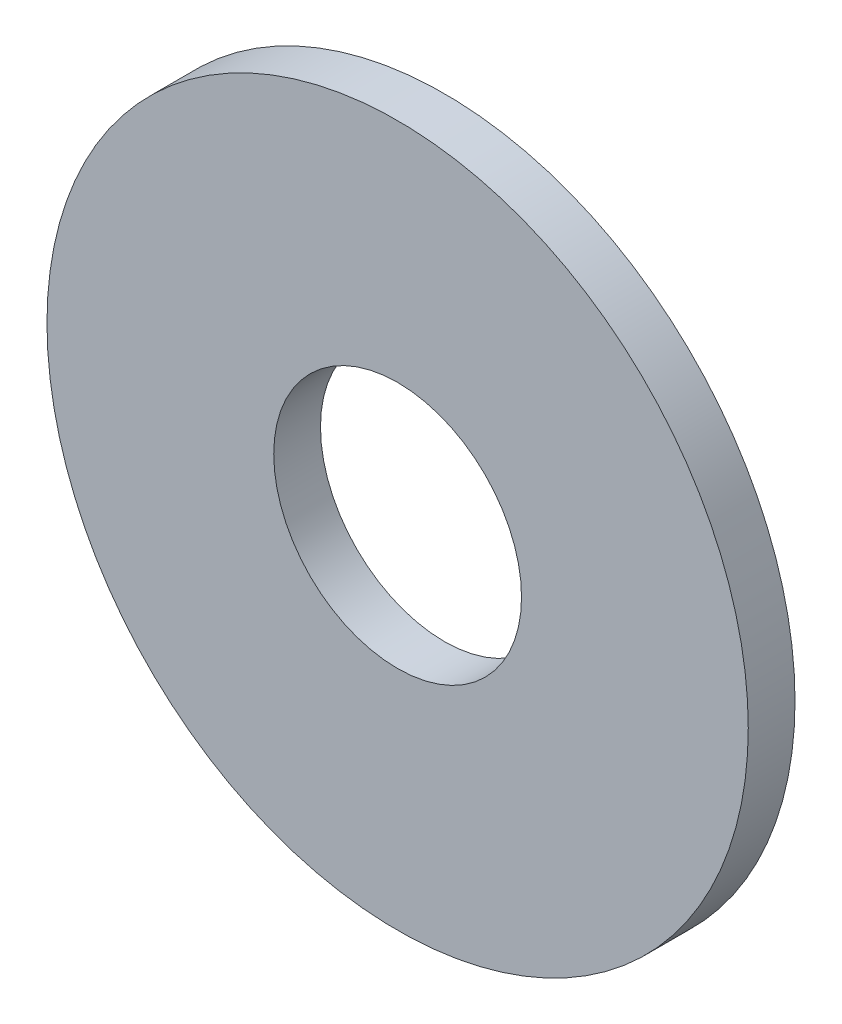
from build123d import *

# Parameters (mm, degrees)
SKETCH1_R      = 7.5
SKETCH1_R_2    = 2.65
EXTRUDE1_DEPTH = 1


with BuildPart() as part:
    # Sketch1 → Extrude1 (new body)
    with BuildSketch(Plane.XY):
        Circle(SKETCH1_R)
        Circle(SKETCH1_R_2, mode=Mode.SUBTRACT)
    extrude(amount=-EXTRUDE1_DEPTH)


solid = part.part
